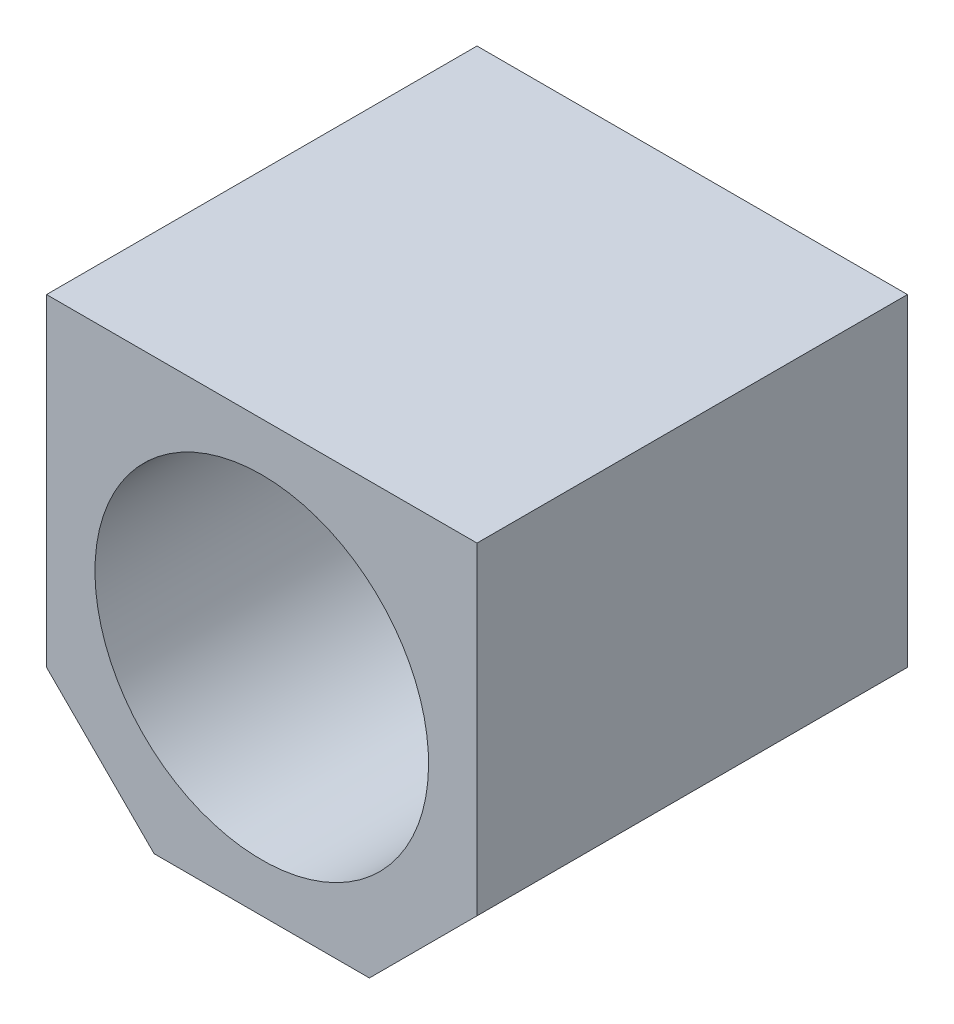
ISO-10303-21;
HEADER;
FILE_DESCRIPTION(('STEP AP214'),'2;1');
FILE_NAME('part.step','',(''),(''),'','','');
FILE_SCHEMA(('AUTOMOTIVE_DESIGN { 1 0 10303 214 1 1 1 1 }'));
ENDSEC;
DATA;
#1=APPLICATION_CONTEXT('core data for automotive mechanical design processes');
#2=APPLICATION_PROTOCOL_DEFINITION('international standard','automotive_design',2000,#1);
#3=PRODUCT_CONTEXT('',#1,'mechanical');
#4=PRODUCT('Part','Part','',(#3));
#5=PRODUCT_RELATED_PRODUCT_CATEGORY('part','',(#4));
#6=PRODUCT_DEFINITION_FORMATION('','',#4);
#7=PRODUCT_DEFINITION_CONTEXT('part definition',#1,'design');
#8=PRODUCT_DEFINITION('design','',#6,#7);
#9=PRODUCT_DEFINITION_SHAPE('','',#8);
#10=(LENGTH_UNIT() NAMED_UNIT(*) SI_UNIT(.MILLI.,.METRE.));
#11=(NAMED_UNIT(*) PLANE_ANGLE_UNIT() SI_UNIT($,.RADIAN.));
#12=(NAMED_UNIT(*) SI_UNIT($,.STERADIAN.) SOLID_ANGLE_UNIT());
#13=UNCERTAINTY_MEASURE_WITH_UNIT(LENGTH_MEASURE(1.E-05),#10,'distance_accuracy_value','');
#14=(GEOMETRIC_REPRESENTATION_CONTEXT(3) GLOBAL_UNCERTAINTY_ASSIGNED_CONTEXT((#13)) GLOBAL_UNIT_ASSIGNED_CONTEXT((#10,
#11,#12)) REPRESENTATION_CONTEXT('',''));
#15=CARTESIAN_POINT('',(0.,0.,0.));
#16=DIRECTION('',(0.,0.,1.));
#17=DIRECTION('',(1.,0.,0.));
#18=AXIS2_PLACEMENT_3D('',#15,#16,#17);
#19=CARTESIAN_POINT('',(60.0586513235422,63.1378299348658,0.));
#20=DIRECTION('',(1.,0.,0.));
#21=DIRECTION('',(0.,0.,-1.));
#22=AXIS2_PLACEMENT_3D('',#19,#20,#21);
#23=PLANE('',#22);
#24=DIRECTION('',(0.,1.,0.));
#25=VECTOR('',#24,1.);
#26=CARTESIAN_POINT('',(60.0586513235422,26.8568478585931,0.));
#27=LINE('',#26,#25);
#28=CARTESIAN_POINT('',(60.0586513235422,3.13782993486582,0.));
#29=VERTEX_POINT('',#28);
#30=CARTESIAN_POINT('',(60.0586513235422,63.1378299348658,0.));
#31=VERTEX_POINT('',#30);
#32=EDGE_CURVE('E117',#29,#31,#27,.T.);
#33=ORIENTED_EDGE('',*,*,#32,.T.);
#34=DIRECTION('',(0.,0.,1.));
#35=VECTOR('',#34,1.);
#36=CARTESIAN_POINT('',(60.0586513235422,63.1378299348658,0.));
#37=LINE('',#36,#35);
#38=CARTESIAN_POINT('',(60.0586513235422,63.1378299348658,80.));
#39=VERTEX_POINT('',#38);
#40=EDGE_CURVE('E61',#39,#31,#37,.F.);
#41=ORIENTED_EDGE('',*,*,#40,.F.);
#42=DIRECTION('',(0.,1.,0.));
#43=VECTOR('',#42,1.);
#44=CARTESIAN_POINT('',(60.0586513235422,26.8568478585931,80.));
#45=LINE('',#44,#43);
#46=CARTESIAN_POINT('',(60.0586513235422,3.13782993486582,80.));
#47=VERTEX_POINT('',#46);
#48=EDGE_CURVE('E114',#47,#39,#45,.T.);
#49=ORIENTED_EDGE('',*,*,#48,.F.);
#50=DIRECTION('',(0.,0.,1.));
#51=VECTOR('',#50,1.);
#52=CARTESIAN_POINT('',(60.0586513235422,3.13782993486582,0.));
#53=LINE('',#52,#51);
#54=EDGE_CURVE('E52',#29,#47,#53,.T.);
#55=ORIENTED_EDGE('',*,*,#54,.F.);
#56=EDGE_LOOP('',(#33,#41,#49,#55));
#57=FACE_BOUND('',#56,.T.);
#58=ADVANCED_FACE('F16',(#57),#23,.T.);
#59=CARTESIAN_POINT('',(-19.9413486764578,63.1378299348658,0.));
#60=DIRECTION('',(0.,1.,0.));
#61=DIRECTION('',(0.,0.,1.));
#62=AXIS2_PLACEMENT_3D('',#59,#60,#61);
#63=PLANE('',#62);
#64=DIRECTION('',(1.,0.,0.));
#65=VECTOR('',#64,1.);
#66=CARTESIAN_POINT('',(20.0586513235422,63.1378299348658,0.));
#67=LINE('',#66,#65);
#68=CARTESIAN_POINT('',(-19.9413486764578,63.1378299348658,0.));
#69=VERTEX_POINT('',#68);
#70=EDGE_CURVE('E115',#31,#69,#67,.F.);
#71=ORIENTED_EDGE('',*,*,#70,.T.);
#72=DIRECTION('',(0.,0.,1.));
#73=VECTOR('',#72,1.);
#74=CARTESIAN_POINT('',(-19.9413486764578,63.1378299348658,0.));
#75=LINE('',#74,#73);
#76=CARTESIAN_POINT('',(-19.9413486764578,63.1378299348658,80.));
#77=VERTEX_POINT('',#76);
#78=EDGE_CURVE('E76',#77,#69,#75,.F.);
#79=ORIENTED_EDGE('',*,*,#78,.F.);
#80=DIRECTION('',(1.,0.,0.));
#81=VECTOR('',#80,1.);
#82=CARTESIAN_POINT('',(20.0586513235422,63.1378299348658,80.));
#83=LINE('',#82,#81);
#84=EDGE_CURVE('E112',#39,#77,#83,.F.);
#85=ORIENTED_EDGE('',*,*,#84,.F.);
#86=ORIENTED_EDGE('',*,*,#40,.T.);
#87=EDGE_LOOP('',(#71,#79,#85,#86));
#88=FACE_BOUND('',#87,.T.);
#89=ADVANCED_FACE('F131',(#88),#63,.T.);
#90=CARTESIAN_POINT('',(-19.9413486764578,3.13782993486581,0.));
#91=DIRECTION('',(-1.,0.,0.));
#92=DIRECTION('',(0.,0.,1.));
#93=AXIS2_PLACEMENT_3D('',#90,#91,#92);
#94=PLANE('',#93);
#95=DIRECTION('',(0.,1.,0.));
#96=VECTOR('',#95,1.);
#97=CARTESIAN_POINT('',(-19.9413486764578,26.8568478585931,0.));
#98=LINE('',#97,#96);
#99=CARTESIAN_POINT('',(-19.9413486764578,3.13782993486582,0.));
#100=VERTEX_POINT('',#99);
#101=EDGE_CURVE('E95',#69,#100,#98,.F.);
#102=ORIENTED_EDGE('',*,*,#101,.T.);
#103=DIRECTION('',(0.,0.,1.));
#104=VECTOR('',#103,1.);
#105=CARTESIAN_POINT('',(-19.9413486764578,3.13782993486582,0.));
#106=LINE('',#105,#104);
#107=CARTESIAN_POINT('',(-19.9413486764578,3.13782993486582,80.));
#108=VERTEX_POINT('',#107);
#109=EDGE_CURVE('E83',#108,#100,#106,.F.);
#110=ORIENTED_EDGE('',*,*,#109,.F.);
#111=DIRECTION('',(0.,1.,0.));
#112=VECTOR('',#111,1.);
#113=CARTESIAN_POINT('',(-19.9413486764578,26.8568478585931,80.));
#114=LINE('',#113,#112);
#115=EDGE_CURVE('E110',#77,#108,#114,.F.);
#116=ORIENTED_EDGE('',*,*,#115,.F.);
#117=ORIENTED_EDGE('',*,*,#78,.T.);
#118=EDGE_LOOP('',(#102,#110,#116,#117));
#119=FACE_BOUND('',#118,.T.);
#120=ADVANCED_FACE('F100',(#119),#94,.T.);
#121=CARTESIAN_POINT('',(0.058651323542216,-16.8621700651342,0.));
#122=DIRECTION('',(-0.707106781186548,-0.707106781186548,0.));
#123=DIRECTION('',(0.707106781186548,-0.707106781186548,0.));
#124=AXIS2_PLACEMENT_3D('',#121,#122,#123);
#125=PLANE('',#124);
#126=DIRECTION('',(0.707106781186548,-0.707106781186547,0.));
#127=VECTOR('',#126,1.);
#128=CARTESIAN_POINT('',(-19.9413486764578,3.13782993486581,0.));
#129=LINE('',#128,#127);
#130=CARTESIAN_POINT('',(0.0586513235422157,-16.8621700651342,0.));
#131=VERTEX_POINT('',#130);
#132=EDGE_CURVE('E87',#100,#131,#129,.T.);
#133=ORIENTED_EDGE('',*,*,#132,.T.);
#134=DIRECTION('',(0.,0.,-1.));
#135=VECTOR('',#134,1.);
#136=CARTESIAN_POINT('',(0.0586513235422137,-16.8621700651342,0.));
#137=LINE('',#136,#135);
#138=CARTESIAN_POINT('',(0.0586513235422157,-16.8621700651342,80.));
#139=VERTEX_POINT('',#138);
#140=EDGE_CURVE('E89',#139,#131,#137,.T.);
#141=ORIENTED_EDGE('',*,*,#140,.F.);
#142=DIRECTION('',(0.707106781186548,-0.707106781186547,0.));
#143=VECTOR('',#142,1.);
#144=CARTESIAN_POINT('',(-19.9413486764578,3.13782993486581,80.));
#145=LINE('',#144,#143);
#146=EDGE_CURVE('E88',#108,#139,#145,.T.);
#147=ORIENTED_EDGE('',*,*,#146,.F.);
#148=ORIENTED_EDGE('',*,*,#109,.T.);
#149=EDGE_LOOP('',(#133,#141,#147,#148));
#150=FACE_BOUND('',#149,.T.);
#151=ADVANCED_FACE('F85',(#150),#125,.T.);
#152=CARTESIAN_POINT('',(40.0586513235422,-16.8621700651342,0.));
#153=DIRECTION('',(0.,-1.,0.));
#154=DIRECTION('',(0.,0.,-1.));
#155=AXIS2_PLACEMENT_3D('',#152,#153,#154);
#156=PLANE('',#155);
#157=DIRECTION('',(1.,0.,0.));
#158=VECTOR('',#157,1.);
#159=CARTESIAN_POINT('',(20.0586513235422,-16.8621700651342,0.));
#160=LINE('',#159,#158);
#161=CARTESIAN_POINT('',(40.0586513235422,-16.8621700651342,0.));
#162=VERTEX_POINT('',#161);
#163=EDGE_CURVE('E98',#131,#162,#160,.T.);
#164=ORIENTED_EDGE('',*,*,#163,.T.);
#165=DIRECTION('',(0.,0.,1.));
#166=VECTOR('',#165,1.);
#167=CARTESIAN_POINT('',(40.0586513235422,-16.8621700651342,0.));
#168=LINE('',#167,#166);
#169=CARTESIAN_POINT('',(40.0586513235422,-16.8621700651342,80.));
#170=VERTEX_POINT('',#169);
#171=EDGE_CURVE('E102',#170,#162,#168,.F.);
#172=ORIENTED_EDGE('',*,*,#171,.F.);
#173=DIRECTION('',(1.,0.,0.));
#174=VECTOR('',#173,1.);
#175=CARTESIAN_POINT('',(20.0586513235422,-16.8621700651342,80.));
#176=LINE('',#175,#174);
#177=EDGE_CURVE('E33',#139,#170,#176,.T.);
#178=ORIENTED_EDGE('',*,*,#177,.F.);
#179=ORIENTED_EDGE('',*,*,#140,.T.);
#180=EDGE_LOOP('',(#164,#172,#178,#179));
#181=FACE_BOUND('',#180,.T.);
#182=ADVANCED_FACE('F125',(#181),#156,.T.);
#183=CARTESIAN_POINT('',(60.0586513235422,3.13782993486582,0.));
#184=DIRECTION('',(0.707106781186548,-0.707106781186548,0.));
#185=DIRECTION('',(0.707106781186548,0.707106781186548,0.));
#186=AXIS2_PLACEMENT_3D('',#183,#184,#185);
#187=PLANE('',#186);
#188=DIRECTION('',(0.707106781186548,0.707106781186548,0.));
#189=VECTOR('',#188,1.);
#190=CARTESIAN_POINT('',(40.0586513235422,-16.8621700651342,0.));
#191=LINE('',#190,#189);
#192=EDGE_CURVE('E120',#162,#29,#191,.T.);
#193=ORIENTED_EDGE('',*,*,#192,.T.);
#194=ORIENTED_EDGE('',*,*,#54,.T.);
#195=DIRECTION('',(0.707106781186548,0.707106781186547,0.));
#196=VECTOR('',#195,1.);
#197=CARTESIAN_POINT('',(40.0586513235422,-16.8621700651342,80.));
#198=LINE('',#197,#196);
#199=EDGE_CURVE('E106',#170,#47,#198,.T.);
#200=ORIENTED_EDGE('',*,*,#199,.F.);
#201=ORIENTED_EDGE('',*,*,#171,.T.);
#202=EDGE_LOOP('',(#193,#194,#200,#201));
#203=FACE_BOUND('',#202,.T.);
#204=ADVANCED_FACE('F129',(#203),#187,.T.);
#205=CARTESIAN_POINT('',(20.0586513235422,26.8568478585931,0.));
#206=DIRECTION('',(0.,0.,1.));
#207=DIRECTION('',(1.,0.,0.));
#208=AXIS2_PLACEMENT_3D('',#205,#206,#207);
#209=PLANE('',#208);
#210=CARTESIAN_POINT('',(20.0586513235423,23.1378299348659,0.));
#211=DIRECTION('',(0.,0.,-1.));
#212=DIRECTION('',(0.,1.,0.));
#213=AXIS2_PLACEMENT_3D('',#210,#211,#212);
#214=CIRCLE('',#213,31.);
#215=CARTESIAN_POINT('',(20.0586513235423,54.1378299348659,0.));
#216=VERTEX_POINT('',#215);
#217=EDGE_CURVE('E20',#216,#216,#214,.F.);
#218=ORIENTED_EDGE('',*,*,#217,.T.);
#219=EDGE_LOOP('',(#218));
#220=FACE_BOUND('',#219,.T.);
#221=ORIENTED_EDGE('',*,*,#32,.F.);
#222=ORIENTED_EDGE('',*,*,#192,.F.);
#223=ORIENTED_EDGE('',*,*,#163,.F.);
#224=ORIENTED_EDGE('',*,*,#132,.F.);
#225=ORIENTED_EDGE('',*,*,#101,.F.);
#226=ORIENTED_EDGE('',*,*,#70,.F.);
#227=EDGE_LOOP('',(#221,#222,#223,#224,#225,#226));
#228=FACE_BOUND('',#227,.T.);
#229=ADVANCED_FACE('F94',(#220,#228),#209,.F.);
#230=CARTESIAN_POINT('',(20.0586513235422,26.8568478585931,80.));
#231=DIRECTION('',(0.,0.,1.));
#232=DIRECTION('',(1.,0.,0.));
#233=AXIS2_PLACEMENT_3D('',#230,#231,#232);
#234=PLANE('',#233);
#235=CARTESIAN_POINT('',(20.0586513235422,23.1378299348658,80.));
#236=DIRECTION('',(0.,0.,-1.));
#237=DIRECTION('',(0.,1.,0.));
#238=AXIS2_PLACEMENT_3D('',#235,#236,#237);
#239=CIRCLE('',#238,31.);
#240=CARTESIAN_POINT('',(20.0586513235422,54.1378299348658,80.));
#241=VERTEX_POINT('',#240);
#242=EDGE_CURVE('E10',#241,#241,#239,.T.);
#243=ORIENTED_EDGE('',*,*,#242,.T.);
#244=EDGE_LOOP('',(#243));
#245=FACE_BOUND('',#244,.T.);
#246=ORIENTED_EDGE('',*,*,#177,.T.);
#247=ORIENTED_EDGE('',*,*,#199,.T.);
#248=ORIENTED_EDGE('',*,*,#48,.T.);
#249=ORIENTED_EDGE('',*,*,#84,.T.);
#250=ORIENTED_EDGE('',*,*,#115,.T.);
#251=ORIENTED_EDGE('',*,*,#146,.T.);
#252=EDGE_LOOP('',(#246,#247,#248,#249,#250,#251));
#253=FACE_BOUND('',#252,.T.);
#254=ADVANCED_FACE('F132',(#245,#253),#234,.T.);
#255=CARTESIAN_POINT('',(20.0586513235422,23.1378299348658,80.));
#256=DIRECTION('',(0.,0.,-1.));
#257=DIRECTION('',(0.,1.,0.));
#258=AXIS2_PLACEMENT_3D('',#255,#256,#257);
#259=CYLINDRICAL_SURFACE('',#258,31.);
#260=ORIENTED_EDGE('',*,*,#242,.F.);
#261=EDGE_LOOP('',(#260));
#262=FACE_BOUND('',#261,.T.);
#263=ORIENTED_EDGE('',*,*,#217,.F.);
#264=EDGE_LOOP('',(#263));
#265=FACE_BOUND('',#264,.T.);
#266=ADVANCED_FACE('F18',(#262,#265),#259,.F.);
#267=CLOSED_SHELL('',(#58,#89,#120,#151,#182,#204,#229,#254,#266));
#268=MANIFOLD_SOLID_BREP('B1',#267);
#269=ADVANCED_BREP_SHAPE_REPRESENTATION('',(#18,#268),#14);
#270=SHAPE_DEFINITION_REPRESENTATION(#9,#269);
ENDSEC;
END-ISO-10303-21;
